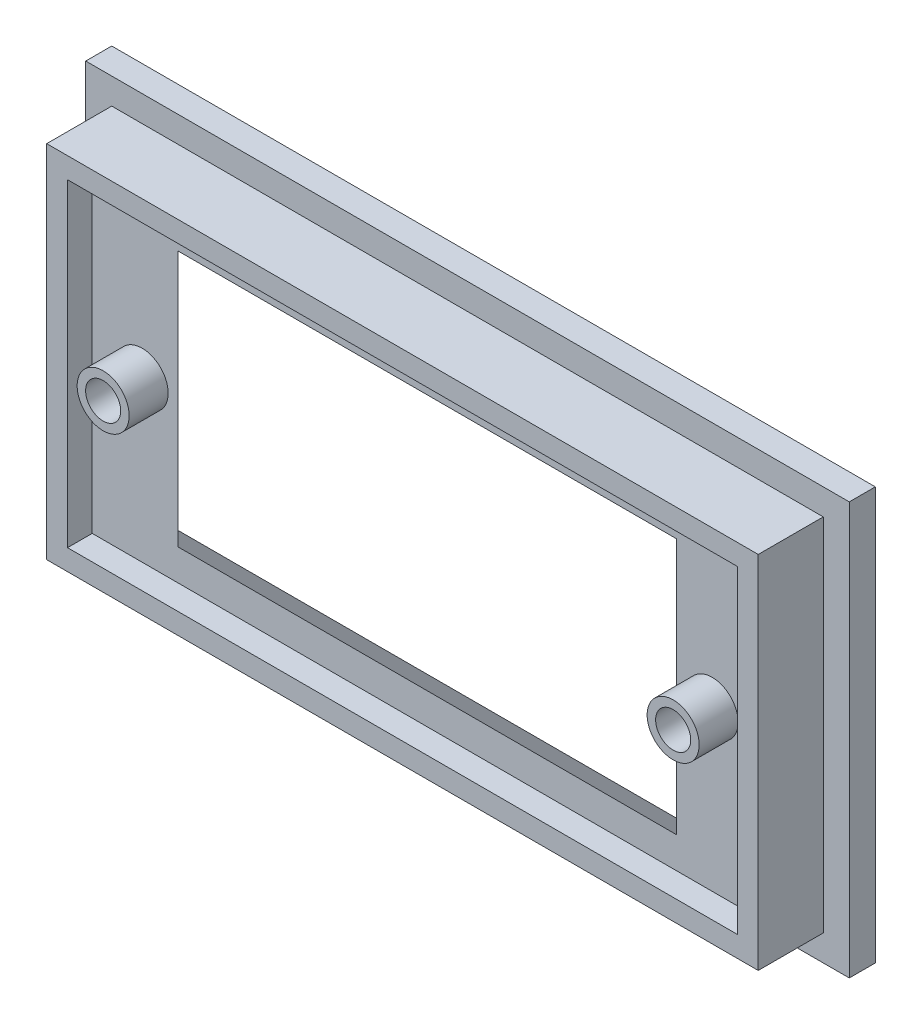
ISO-10303-21;
HEADER;
FILE_DESCRIPTION(('STEP AP214'),'2;1');
FILE_NAME('part.step','',(''),(''),'','','');
FILE_SCHEMA(('AUTOMOTIVE_DESIGN { 1 0 10303 214 1 1 1 1 }'));
ENDSEC;
DATA;
#1=APPLICATION_CONTEXT('core data for automotive mechanical design processes');
#2=APPLICATION_PROTOCOL_DEFINITION('international standard','automotive_design',2000,#1);
#3=PRODUCT_CONTEXT('',#1,'mechanical');
#4=PRODUCT('Part','Part','',(#3));
#5=PRODUCT_RELATED_PRODUCT_CATEGORY('part','',(#4));
#6=PRODUCT_DEFINITION_FORMATION('','',#4);
#7=PRODUCT_DEFINITION_CONTEXT('part definition',#1,'design');
#8=PRODUCT_DEFINITION('design','',#6,#7);
#9=PRODUCT_DEFINITION_SHAPE('','',#8);
#10=(LENGTH_UNIT() NAMED_UNIT(*) SI_UNIT(.MILLI.,.METRE.));
#11=(NAMED_UNIT(*) PLANE_ANGLE_UNIT() SI_UNIT($,.RADIAN.));
#12=(NAMED_UNIT(*) SI_UNIT($,.STERADIAN.) SOLID_ANGLE_UNIT());
#13=UNCERTAINTY_MEASURE_WITH_UNIT(LENGTH_MEASURE(1.E-05),#10,'distance_accuracy_value','');
#14=(GEOMETRIC_REPRESENTATION_CONTEXT(3) GLOBAL_UNCERTAINTY_ASSIGNED_CONTEXT((#13)) GLOBAL_UNIT_ASSIGNED_CONTEXT((#10,
#11,#12)) REPRESENTATION_CONTEXT('',''));
#15=CARTESIAN_POINT('',(0.,0.,0.));
#16=DIRECTION('',(0.,0.,1.));
#17=DIRECTION('',(1.,0.,0.));
#18=AXIS2_PLACEMENT_3D('',#15,#16,#17);
#19=CARTESIAN_POINT('',(0.,0.,0.));
#20=DIRECTION('',(0.,0.,1.));
#21=DIRECTION('',(1.,0.,0.));
#22=AXIS2_PLACEMENT_3D('',#19,#20,#21);
#23=PLANE('',#22);
#24=DIRECTION('',(0.,-1.,0.));
#25=VECTOR('',#24,1.);
#26=CARTESIAN_POINT('',(-40.8503021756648,13.1480392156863,0.));
#27=LINE('',#26,#25);
#28=CARTESIAN_POINT('',(-40.8503021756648,13.1480392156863,0.));
#29=VERTEX_POINT('',#28);
#30=CARTESIAN_POINT('',(-40.8503021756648,-18.5519607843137,0.));
#31=VERTEX_POINT('',#30);
#32=EDGE_CURVE('E274',#29,#31,#27,.T.);
#33=ORIENTED_EDGE('',*,*,#32,.F.);
#34=DIRECTION('',(-1.,0.,0.));
#35=VECTOR('',#34,1.);
#36=CARTESIAN_POINT('',(-40.8503021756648,13.1480392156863,0.));
#37=LINE('',#36,#35);
#38=CARTESIAN_POINT('',(17.8496978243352,13.1480392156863,0.));
#39=VERTEX_POINT('',#38);
#40=EDGE_CURVE('E283',#39,#29,#37,.T.);
#41=ORIENTED_EDGE('',*,*,#40,.F.);
#42=DIRECTION('',(0.,1.,0.));
#43=VECTOR('',#42,1.);
#44=CARTESIAN_POINT('',(17.8496978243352,13.1480392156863,0.));
#45=LINE('',#44,#43);
#46=CARTESIAN_POINT('',(17.8496978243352,-18.5519607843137,0.));
#47=VERTEX_POINT('',#46);
#48=EDGE_CURVE('E280',#47,#39,#45,.T.);
#49=ORIENTED_EDGE('',*,*,#48,.F.);
#50=DIRECTION('',(1.,0.,0.));
#51=VECTOR('',#50,1.);
#52=CARTESIAN_POINT('',(-40.8503021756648,-18.5519607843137,0.));
#53=LINE('',#52,#51);
#54=EDGE_CURVE('E277',#31,#47,#53,.T.);
#55=ORIENTED_EDGE('',*,*,#54,.F.);
#56=EDGE_LOOP('',(#33,#41,#49,#55));
#57=FACE_BOUND('',#56,.T.);
#58=DIRECTION('',(1.,0.,0.));
#59=VECTOR('',#58,1.);
#60=CARTESIAN_POINT('',(-75.4981782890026,11.1480392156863,0.));
#61=LINE('',#60,#59);
#62=CARTESIAN_POINT('',(-38.8503021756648,11.1480392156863,0.));
#63=VERTEX_POINT('',#62);
#64=CARTESIAN_POINT('',(15.8496978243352,11.1480392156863,0.));
#65=VERTEX_POINT('',#64);
#66=EDGE_CURVE('E154',#63,#65,#61,.T.);
#67=ORIENTED_EDGE('',*,*,#66,.F.);
#68=DIRECTION('',(0.,-1.,0.));
#69=VECTOR('',#68,1.);
#70=CARTESIAN_POINT('',(-38.8503021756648,62.0852761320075,0.));
#71=LINE('',#70,#69);
#72=CARTESIAN_POINT('',(-38.8503021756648,-16.5519607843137,0.));
#73=VERTEX_POINT('',#72);
#74=EDGE_CURVE('E161',#63,#73,#71,.T.);
#75=ORIENTED_EDGE('',*,*,#74,.T.);
#76=DIRECTION('',(1.,0.,0.));
#77=VECTOR('',#76,1.);
#78=CARTESIAN_POINT('',(-75.4981782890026,-16.5519607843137,0.));
#79=LINE('',#78,#77);
#80=CARTESIAN_POINT('',(15.8496978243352,-16.5519607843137,0.));
#81=VERTEX_POINT('',#80);
#82=EDGE_CURVE('E156',#73,#81,#79,.T.);
#83=ORIENTED_EDGE('',*,*,#82,.T.);
#84=DIRECTION('',(0.,-1.,0.));
#85=VECTOR('',#84,1.);
#86=CARTESIAN_POINT('',(15.8496978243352,62.0852761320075,0.));
#87=LINE('',#86,#85);
#88=EDGE_CURVE('E152',#65,#81,#87,.T.);
#89=ORIENTED_EDGE('',*,*,#88,.F.);
#90=EDGE_LOOP('',(#67,#75,#83,#89));
#91=FACE_BOUND('',#90,.T.);
#92=ADVANCED_FACE('F38',(#57,#91),#23,.F.);
#93=CARTESIAN_POINT('',(0.,0.,5.1));
#94=DIRECTION('',(0.,0.,1.));
#95=DIRECTION('',(1.,0.,0.));
#96=AXIS2_PLACEMENT_3D('',#93,#94,#95);
#97=PLANE('',#96);
#98=DIRECTION('',(-1.,0.,0.));
#99=VECTOR('',#98,1.);
#100=CARTESIAN_POINT('',(-30.6503021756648,7.14803921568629,5.1));
#101=LINE('',#100,#99);
#102=CARTESIAN_POINT('',(7.64969782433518,7.14803921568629,5.1));
#103=VERTEX_POINT('',#102);
#104=CARTESIAN_POINT('',(-30.6503021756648,7.14803921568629,5.1));
#105=VERTEX_POINT('',#104);
#106=EDGE_CURVE('E296',#103,#105,#101,.T.);
#107=ORIENTED_EDGE('',*,*,#106,.F.);
#108=DIRECTION('',(0.,1.,0.));
#109=VECTOR('',#108,1.);
#110=CARTESIAN_POINT('',(7.64969782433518,7.14803921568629,5.1));
#111=LINE('',#110,#109);
#112=CARTESIAN_POINT('',(7.64969782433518,-12.5519607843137,5.1));
#113=VERTEX_POINT('',#112);
#114=EDGE_CURVE('E173',#113,#103,#111,.T.);
#115=ORIENTED_EDGE('',*,*,#114,.F.);
#116=DIRECTION('',(1.,0.,0.));
#117=VECTOR('',#116,1.);
#118=CARTESIAN_POINT('',(-30.6503021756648,-12.5519607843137,5.1));
#119=LINE('',#118,#117);
#120=CARTESIAN_POINT('',(-30.6503021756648,-12.5519607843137,5.1));
#121=VERTEX_POINT('',#120);
#122=EDGE_CURVE('E232',#121,#113,#119,.T.);
#123=ORIENTED_EDGE('',*,*,#122,.F.);
#124=DIRECTION('',(0.,-1.,0.));
#125=VECTOR('',#124,1.);
#126=CARTESIAN_POINT('',(-30.6503021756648,7.14803921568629,5.1));
#127=LINE('',#126,#125);
#128=EDGE_CURVE('E235',#105,#121,#127,.T.);
#129=ORIENTED_EDGE('',*,*,#128,.F.);
#130=EDGE_LOOP('',(#107,#115,#123,#129));
#131=FACE_BOUND('',#130,.T.);
#132=DIRECTION('',(0.,-1.,0.));
#133=VECTOR('',#132,1.);
#134=CARTESIAN_POINT('',(-37.2503021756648,9.54803921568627,5.1));
#135=LINE('',#134,#133);
#136=CARTESIAN_POINT('',(-37.2503021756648,9.54803921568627,5.1));
#137=VERTEX_POINT('',#136);
#138=CARTESIAN_POINT('',(-37.2503021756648,-14.9519607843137,5.1));
#139=VERTEX_POINT('',#138);
#140=EDGE_CURVE('E201',#137,#139,#135,.T.);
#141=ORIENTED_EDGE('',*,*,#140,.T.);
#142=DIRECTION('',(1.,0.,0.));
#143=VECTOR('',#142,1.);
#144=CARTESIAN_POINT('',(-37.2503021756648,-14.9519607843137,5.1));
#145=LINE('',#144,#143);
#146=CARTESIAN_POINT('',(14.2496978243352,-14.9519607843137,5.1));
#147=VERTEX_POINT('',#146);
#148=EDGE_CURVE('E204',#139,#147,#145,.T.);
#149=ORIENTED_EDGE('',*,*,#148,.T.);
#150=DIRECTION('',(0.,1.,0.));
#151=VECTOR('',#150,1.);
#152=CARTESIAN_POINT('',(14.2496978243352,9.54803921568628,5.1));
#153=LINE('',#152,#151);
#154=CARTESIAN_POINT('',(14.2496978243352,9.54803921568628,5.1));
#155=VERTEX_POINT('',#154);
#156=EDGE_CURVE('E208',#147,#155,#153,.T.);
#157=ORIENTED_EDGE('',*,*,#156,.T.);
#158=DIRECTION('',(-1.,0.,0.));
#159=VECTOR('',#158,1.);
#160=CARTESIAN_POINT('',(-37.2503021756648,9.54803921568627,5.1));
#161=LINE('',#160,#159);
#162=EDGE_CURVE('E211',#155,#137,#161,.T.);
#163=ORIENTED_EDGE('',*,*,#162,.T.);
#164=EDGE_LOOP('',(#141,#149,#157,#163));
#165=FACE_BOUND('',#164,.T.);
#166=CARTESIAN_POINT('',(-33.4103021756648,-2.70196078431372,5.1));
#167=DIRECTION('',(0.,0.,1.));
#168=DIRECTION('',(1.,0.,0.));
#169=AXIS2_PLACEMENT_3D('',#166,#167,#168);
#170=CIRCLE('',#169,2.);
#171=CARTESIAN_POINT('',(-31.4103021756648,-2.70196078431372,5.1));
#172=VERTEX_POINT('',#171);
#173=EDGE_CURVE('E195',#172,#172,#170,.T.);
#174=ORIENTED_EDGE('',*,*,#173,.F.);
#175=EDGE_LOOP('',(#174));
#176=FACE_BOUND('',#175,.T.);
#177=CARTESIAN_POINT('',(10.4096978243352,-2.70196078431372,5.1));
#178=DIRECTION('',(0.,0.,1.));
#179=DIRECTION('',(1.,0.,0.));
#180=AXIS2_PLACEMENT_3D('',#177,#178,#179);
#181=CIRCLE('',#180,2.);
#182=CARTESIAN_POINT('',(12.4096978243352,-2.70196078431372,5.1));
#183=VERTEX_POINT('',#182);
#184=EDGE_CURVE('E186',#183,#183,#181,.T.);
#185=ORIENTED_EDGE('',*,*,#184,.F.);
#186=EDGE_LOOP('',(#185));
#187=FACE_BOUND('',#186,.T.);
#188=ADVANCED_FACE('F306',(#131,#165,#176,#187),#97,.T.);
#189=CARTESIAN_POINT('',(0.,0.,7.));
#190=DIRECTION('',(0.,0.,1.));
#191=DIRECTION('',(1.,0.,0.));
#192=AXIS2_PLACEMENT_3D('',#189,#190,#191);
#193=PLANE('',#192);
#194=DIRECTION('',(0.,-1.,0.));
#195=VECTOR('',#194,1.);
#196=CARTESIAN_POINT('',(-37.2503021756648,9.54803921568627,7.));
#197=LINE('',#196,#195);
#198=CARTESIAN_POINT('',(-37.2503021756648,9.54803921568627,7.));
#199=VERTEX_POINT('',#198);
#200=CARTESIAN_POINT('',(-37.2503021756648,-14.9519607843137,7.));
#201=VERTEX_POINT('',#200);
#202=EDGE_CURVE('E53',#199,#201,#197,.T.);
#203=ORIENTED_EDGE('',*,*,#202,.F.);
#204=DIRECTION('',(-1.,0.,0.));
#205=VECTOR('',#204,1.);
#206=CARTESIAN_POINT('',(-37.2503021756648,9.54803921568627,7.));
#207=LINE('',#206,#205);
#208=CARTESIAN_POINT('',(14.2496978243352,9.54803921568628,7.));
#209=VERTEX_POINT('',#208);
#210=EDGE_CURVE('E205',#209,#199,#207,.T.);
#211=ORIENTED_EDGE('',*,*,#210,.F.);
#212=DIRECTION('',(0.,1.,0.));
#213=VECTOR('',#212,1.);
#214=CARTESIAN_POINT('',(14.2496978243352,9.54803921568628,7.));
#215=LINE('',#214,#213);
#216=CARTESIAN_POINT('',(14.2496978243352,-14.9519607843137,7.));
#217=VERTEX_POINT('',#216);
#218=EDGE_CURVE('E219',#217,#209,#215,.T.);
#219=ORIENTED_EDGE('',*,*,#218,.F.);
#220=DIRECTION('',(1.,0.,0.));
#221=VECTOR('',#220,1.);
#222=CARTESIAN_POINT('',(-37.2503021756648,-14.9519607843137,7.));
#223=LINE('',#222,#221);
#224=EDGE_CURVE('E216',#201,#217,#223,.T.);
#225=ORIENTED_EDGE('',*,*,#224,.F.);
#226=EDGE_LOOP('',(#203,#211,#219,#225));
#227=FACE_BOUND('',#226,.T.);
#228=DIRECTION('',(-1.,0.,0.));
#229=VECTOR('',#228,1.);
#230=CARTESIAN_POINT('',(-38.8503021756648,11.1480392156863,7.));
#231=LINE('',#230,#229);
#232=CARTESIAN_POINT('',(15.8496978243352,11.1480392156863,7.));
#233=VERTEX_POINT('',#232);
#234=CARTESIAN_POINT('',(-38.8503021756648,11.1480392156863,7.));
#235=VERTEX_POINT('',#234);
#236=EDGE_CURVE('E243',#233,#235,#231,.T.);
#237=ORIENTED_EDGE('',*,*,#236,.T.);
#238=DIRECTION('',(0.,-1.,0.));
#239=VECTOR('',#238,1.);
#240=CARTESIAN_POINT('',(-38.8503021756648,11.1480392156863,7.));
#241=LINE('',#240,#239);
#242=CARTESIAN_POINT('',(-38.8503021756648,-16.5519607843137,7.));
#243=VERTEX_POINT('',#242);
#244=EDGE_CURVE('E238',#235,#243,#241,.T.);
#245=ORIENTED_EDGE('',*,*,#244,.T.);
#246=DIRECTION('',(1.,0.,0.));
#247=VECTOR('',#246,1.);
#248=CARTESIAN_POINT('',(-38.8503021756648,-16.5519607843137,7.));
#249=LINE('',#248,#247);
#250=CARTESIAN_POINT('',(15.8496978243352,-16.5519607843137,7.));
#251=VERTEX_POINT('',#250);
#252=EDGE_CURVE('E255',#243,#251,#249,.T.);
#253=ORIENTED_EDGE('',*,*,#252,.T.);
#254=DIRECTION('',(0.,1.,0.));
#255=VECTOR('',#254,1.);
#256=CARTESIAN_POINT('',(15.8496978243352,11.1480392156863,7.));
#257=LINE('',#256,#255);
#258=EDGE_CURVE('E61',#251,#233,#257,.T.);
#259=ORIENTED_EDGE('',*,*,#258,.T.);
#260=EDGE_LOOP('',(#237,#245,#253,#259));
#261=FACE_BOUND('',#260,.T.);
#262=ADVANCED_FACE('F321',(#227,#261),#193,.T.);
#263=CARTESIAN_POINT('',(-40.8503021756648,13.1480392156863,7.));
#264=DIRECTION('',(1.,0.,0.));
#265=DIRECTION('',(0.,0.,-1.));
#266=AXIS2_PLACEMENT_3D('',#263,#264,#265);
#267=PLANE('',#266);
#268=DIRECTION('',(0.,-1.,0.));
#269=VECTOR('',#268,1.);
#270=CARTESIAN_POINT('',(-40.8503021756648,13.1480392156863,2.));
#271=LINE('',#270,#269);
#272=CARTESIAN_POINT('',(-40.8503021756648,13.1480392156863,2.));
#273=VERTEX_POINT('',#272);
#274=CARTESIAN_POINT('',(-40.8503021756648,-18.5519607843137,2.));
#275=VERTEX_POINT('',#274);
#276=EDGE_CURVE('E272',#273,#275,#271,.T.);
#277=ORIENTED_EDGE('',*,*,#276,.F.);
#278=DIRECTION('',(0.,0.,-1.));
#279=VECTOR('',#278,1.);
#280=CARTESIAN_POINT('',(-40.8503021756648,13.1480392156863,7.));
#281=LINE('',#280,#279);
#282=EDGE_CURVE('E286',#273,#29,#281,.T.);
#283=ORIENTED_EDGE('',*,*,#282,.T.);
#284=ORIENTED_EDGE('',*,*,#32,.T.);
#285=DIRECTION('',(0.,0.,-1.));
#286=VECTOR('',#285,1.);
#287=CARTESIAN_POINT('',(-40.8503021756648,-18.5519607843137,7.));
#288=LINE('',#287,#286);
#289=EDGE_CURVE('E292',#275,#31,#288,.T.);
#290=ORIENTED_EDGE('',*,*,#289,.F.);
#291=EDGE_LOOP('',(#277,#283,#284,#290));
#292=FACE_BOUND('',#291,.T.);
#293=ADVANCED_FACE('F40',(#292),#267,.F.);
#294=CARTESIAN_POINT('',(-40.8503021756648,-18.5519607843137,7.));
#295=DIRECTION('',(0.,1.,0.));
#296=DIRECTION('',(0.,0.,1.));
#297=AXIS2_PLACEMENT_3D('',#294,#295,#296);
#298=PLANE('',#297);
#299=DIRECTION('',(1.,0.,0.));
#300=VECTOR('',#299,1.);
#301=CARTESIAN_POINT('',(-40.8503021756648,-18.5519607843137,2.));
#302=LINE('',#301,#300);
#303=CARTESIAN_POINT('',(17.8496978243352,-18.5519607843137,2.));
#304=VERTEX_POINT('',#303);
#305=EDGE_CURVE('E270',#275,#304,#302,.T.);
#306=ORIENTED_EDGE('',*,*,#305,.F.);
#307=ORIENTED_EDGE('',*,*,#289,.T.);
#308=ORIENTED_EDGE('',*,*,#54,.T.);
#309=DIRECTION('',(0.,0.,-1.));
#310=VECTOR('',#309,1.);
#311=CARTESIAN_POINT('',(17.8496978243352,-18.5519607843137,7.));
#312=LINE('',#311,#310);
#313=EDGE_CURVE('E290',#304,#47,#312,.T.);
#314=ORIENTED_EDGE('',*,*,#313,.F.);
#315=EDGE_LOOP('',(#306,#307,#308,#314));
#316=FACE_BOUND('',#315,.T.);
#317=ADVANCED_FACE('F343',(#316),#298,.F.);
#318=CARTESIAN_POINT('',(17.8496978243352,13.1480392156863,7.));
#319=DIRECTION('',(-1.,0.,0.));
#320=DIRECTION('',(0.,-1.,0.));
#321=AXIS2_PLACEMENT_3D('',#318,#319,#320);
#322=PLANE('',#321);
#323=DIRECTION('',(0.,1.,0.));
#324=VECTOR('',#323,1.);
#325=CARTESIAN_POINT('',(17.8496978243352,13.1480392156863,2.));
#326=LINE('',#325,#324);
#327=CARTESIAN_POINT('',(17.8496978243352,13.1480392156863,2.));
#328=VERTEX_POINT('',#327);
#329=EDGE_CURVE('E263',#304,#328,#326,.T.);
#330=ORIENTED_EDGE('',*,*,#329,.F.);
#331=ORIENTED_EDGE('',*,*,#313,.T.);
#332=ORIENTED_EDGE('',*,*,#48,.T.);
#333=DIRECTION('',(0.,0.,-1.));
#334=VECTOR('',#333,1.);
#335=CARTESIAN_POINT('',(17.8496978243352,13.1480392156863,7.));
#336=LINE('',#335,#334);
#337=EDGE_CURVE('E288',#328,#39,#336,.T.);
#338=ORIENTED_EDGE('',*,*,#337,.F.);
#339=EDGE_LOOP('',(#330,#331,#332,#338));
#340=FACE_BOUND('',#339,.T.);
#341=ADVANCED_FACE('F340',(#340),#322,.F.);
#342=CARTESIAN_POINT('',(-40.8503021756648,13.1480392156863,7.));
#343=DIRECTION('',(0.,-1.,0.));
#344=DIRECTION('',(0.,0.,-1.));
#345=AXIS2_PLACEMENT_3D('',#342,#343,#344);
#346=PLANE('',#345);
#347=DIRECTION('',(-1.,0.,0.));
#348=VECTOR('',#347,1.);
#349=CARTESIAN_POINT('',(-40.8503021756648,13.1480392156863,2.));
#350=LINE('',#349,#348);
#351=EDGE_CURVE('E294',#328,#273,#350,.T.);
#352=ORIENTED_EDGE('',*,*,#351,.F.);
#353=ORIENTED_EDGE('',*,*,#337,.T.);
#354=ORIENTED_EDGE('',*,*,#40,.T.);
#355=ORIENTED_EDGE('',*,*,#282,.F.);
#356=EDGE_LOOP('',(#352,#353,#354,#355));
#357=FACE_BOUND('',#356,.T.);
#358=ADVANCED_FACE('F336',(#357),#346,.F.);
#359=CARTESIAN_POINT('',(-11.5003021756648,-2.70196078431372,2.));
#360=DIRECTION('',(0.,0.,1.));
#361=DIRECTION('',(1.,0.,0.));
#362=AXIS2_PLACEMENT_3D('',#359,#360,#361);
#363=PLANE('',#362);
#364=DIRECTION('',(-1.,0.,0.));
#365=VECTOR('',#364,1.);
#366=CARTESIAN_POINT('',(-38.8503021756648,11.1480392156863,2.));
#367=LINE('',#366,#365);
#368=CARTESIAN_POINT('',(15.8496978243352,11.1480392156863,2.));
#369=VERTEX_POINT('',#368);
#370=CARTESIAN_POINT('',(-38.8503021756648,11.1480392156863,2.));
#371=VERTEX_POINT('',#370);
#372=EDGE_CURVE('E249',#369,#371,#367,.T.);
#373=ORIENTED_EDGE('',*,*,#372,.F.);
#374=DIRECTION('',(0.,1.,0.));
#375=VECTOR('',#374,1.);
#376=CARTESIAN_POINT('',(15.8496978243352,11.1480392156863,2.));
#377=LINE('',#376,#375);
#378=CARTESIAN_POINT('',(15.8496978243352,-16.5519607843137,2.));
#379=VERTEX_POINT('',#378);
#380=EDGE_CURVE('E246',#379,#369,#377,.T.);
#381=ORIENTED_EDGE('',*,*,#380,.F.);
#382=DIRECTION('',(1.,0.,0.));
#383=VECTOR('',#382,1.);
#384=CARTESIAN_POINT('',(-38.8503021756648,-16.5519607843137,2.));
#385=LINE('',#384,#383);
#386=CARTESIAN_POINT('',(-38.8503021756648,-16.5519607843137,2.));
#387=VERTEX_POINT('',#386);
#388=EDGE_CURVE('E242',#387,#379,#385,.T.);
#389=ORIENTED_EDGE('',*,*,#388,.F.);
#390=DIRECTION('',(0.,-1.,0.));
#391=VECTOR('',#390,1.);
#392=CARTESIAN_POINT('',(-38.8503021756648,11.1480392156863,2.));
#393=LINE('',#392,#391);
#394=EDGE_CURVE('E239',#371,#387,#393,.T.);
#395=ORIENTED_EDGE('',*,*,#394,.F.);
#396=EDGE_LOOP('',(#373,#381,#389,#395));
#397=FACE_BOUND('',#396,.T.);
#398=ORIENTED_EDGE('',*,*,#276,.T.);
#399=ORIENTED_EDGE('',*,*,#305,.T.);
#400=ORIENTED_EDGE('',*,*,#329,.T.);
#401=ORIENTED_EDGE('',*,*,#351,.T.);
#402=EDGE_LOOP('',(#398,#399,#400,#401));
#403=FACE_BOUND('',#402,.T.);
#404=ADVANCED_FACE('F339',(#397,#403),#363,.T.);
#405=CARTESIAN_POINT('',(-38.8503021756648,11.1480392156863,2.));
#406=DIRECTION('',(-1.,0.,0.));
#407=DIRECTION('',(0.,-1.,0.));
#408=AXIS2_PLACEMENT_3D('',#405,#406,#407);
#409=PLANE('',#408);
#410=ORIENTED_EDGE('',*,*,#244,.F.);
#411=DIRECTION('',(0.,0.,1.));
#412=VECTOR('',#411,1.);
#413=CARTESIAN_POINT('',(-38.8503021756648,11.1480392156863,2.));
#414=LINE('',#413,#412);
#415=EDGE_CURVE('E261',#371,#235,#414,.T.);
#416=ORIENTED_EDGE('',*,*,#415,.F.);
#417=ORIENTED_EDGE('',*,*,#394,.T.);
#418=DIRECTION('',(0.,0.,1.));
#419=VECTOR('',#418,1.);
#420=CARTESIAN_POINT('',(-38.8503021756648,-16.5519607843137,2.));
#421=LINE('',#420,#419);
#422=EDGE_CURVE('E252',#387,#243,#421,.T.);
#423=ORIENTED_EDGE('',*,*,#422,.T.);
#424=EDGE_LOOP('',(#410,#416,#417,#423));
#425=FACE_BOUND('',#424,.T.);
#426=ADVANCED_FACE('F364',(#425),#409,.T.);
#427=CARTESIAN_POINT('',(-38.8503021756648,11.1480392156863,2.));
#428=DIRECTION('',(0.,1.,0.));
#429=DIRECTION('',(-1.,0.,0.));
#430=AXIS2_PLACEMENT_3D('',#427,#428,#429);
#431=PLANE('',#430);
#432=ORIENTED_EDGE('',*,*,#236,.F.);
#433=DIRECTION('',(0.,0.,1.));
#434=VECTOR('',#433,1.);
#435=CARTESIAN_POINT('',(15.8496978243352,11.1480392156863,2.));
#436=LINE('',#435,#434);
#437=EDGE_CURVE('E264',#369,#233,#436,.T.);
#438=ORIENTED_EDGE('',*,*,#437,.F.);
#439=ORIENTED_EDGE('',*,*,#372,.T.);
#440=ORIENTED_EDGE('',*,*,#415,.T.);
#441=EDGE_LOOP('',(#432,#438,#439,#440));
#442=FACE_BOUND('',#441,.T.);
#443=ADVANCED_FACE('F369',(#442),#431,.T.);
#444=CARTESIAN_POINT('',(15.8496978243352,11.1480392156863,2.));
#445=DIRECTION('',(1.,0.,0.));
#446=DIRECTION('',(0.,0.,-1.));
#447=AXIS2_PLACEMENT_3D('',#444,#445,#446);
#448=PLANE('',#447);
#449=ORIENTED_EDGE('',*,*,#258,.F.);
#450=DIRECTION('',(0.,0.,1.));
#451=VECTOR('',#450,1.);
#452=CARTESIAN_POINT('',(15.8496978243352,-16.5519607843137,2.));
#453=LINE('',#452,#451);
#454=EDGE_CURVE('E266',#379,#251,#453,.T.);
#455=ORIENTED_EDGE('',*,*,#454,.F.);
#456=ORIENTED_EDGE('',*,*,#380,.T.);
#457=ORIENTED_EDGE('',*,*,#437,.T.);
#458=EDGE_LOOP('',(#449,#455,#456,#457));
#459=FACE_BOUND('',#458,.T.);
#460=ADVANCED_FACE('F378',(#459),#448,.T.);
#461=CARTESIAN_POINT('',(-38.8503021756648,-16.5519607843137,2.));
#462=DIRECTION('',(0.,-1.,0.));
#463=DIRECTION('',(1.,0.,0.));
#464=AXIS2_PLACEMENT_3D('',#461,#462,#463);
#465=PLANE('',#464);
#466=ORIENTED_EDGE('',*,*,#252,.F.);
#467=ORIENTED_EDGE('',*,*,#422,.F.);
#468=ORIENTED_EDGE('',*,*,#388,.T.);
#469=ORIENTED_EDGE('',*,*,#454,.T.);
#470=EDGE_LOOP('',(#466,#467,#468,#469));
#471=FACE_BOUND('',#470,.T.);
#472=ADVANCED_FACE('F374',(#471),#465,.T.);
#473=CARTESIAN_POINT('',(-37.2503021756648,9.54803921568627,5.1));
#474=DIRECTION('',(-1.,0.,0.));
#475=DIRECTION('',(0.,-1.,0.));
#476=AXIS2_PLACEMENT_3D('',#473,#474,#475);
#477=PLANE('',#476);
#478=ORIENTED_EDGE('',*,*,#202,.T.);
#479=DIRECTION('',(0.,0.,1.));
#480=VECTOR('',#479,1.);
#481=CARTESIAN_POINT('',(-37.2503021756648,-14.9519607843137,5.1));
#482=LINE('',#481,#480);
#483=EDGE_CURVE('E214',#139,#201,#482,.T.);
#484=ORIENTED_EDGE('',*,*,#483,.F.);
#485=ORIENTED_EDGE('',*,*,#140,.F.);
#486=DIRECTION('',(0.,0.,1.));
#487=VECTOR('',#486,1.);
#488=CARTESIAN_POINT('',(-37.2503021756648,9.54803921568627,5.1));
#489=LINE('',#488,#487);
#490=EDGE_CURVE('E224',#137,#199,#489,.T.);
#491=ORIENTED_EDGE('',*,*,#490,.T.);
#492=EDGE_LOOP('',(#478,#484,#485,#491));
#493=FACE_BOUND('',#492,.T.);
#494=ADVANCED_FACE('F377',(#493),#477,.F.);
#495=CARTESIAN_POINT('',(-37.2503021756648,9.54803921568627,5.1));
#496=DIRECTION('',(0.,1.,0.));
#497=DIRECTION('',(-1.,0.,0.));
#498=AXIS2_PLACEMENT_3D('',#495,#496,#497);
#499=PLANE('',#498);
#500=ORIENTED_EDGE('',*,*,#210,.T.);
#501=ORIENTED_EDGE('',*,*,#490,.F.);
#502=ORIENTED_EDGE('',*,*,#162,.F.);
#503=DIRECTION('',(0.,0.,1.));
#504=VECTOR('',#503,1.);
#505=CARTESIAN_POINT('',(14.2496978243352,9.54803921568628,5.1));
#506=LINE('',#505,#504);
#507=EDGE_CURVE('E226',#155,#209,#506,.T.);
#508=ORIENTED_EDGE('',*,*,#507,.T.);
#509=EDGE_LOOP('',(#500,#501,#502,#508));
#510=FACE_BOUND('',#509,.T.);
#511=ADVANCED_FACE('F387',(#510),#499,.F.);
#512=CARTESIAN_POINT('',(14.2496978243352,9.54803921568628,5.1));
#513=DIRECTION('',(1.,0.,0.));
#514=DIRECTION('',(0.,0.,-1.));
#515=AXIS2_PLACEMENT_3D('',#512,#513,#514);
#516=PLANE('',#515);
#517=ORIENTED_EDGE('',*,*,#218,.T.);
#518=ORIENTED_EDGE('',*,*,#507,.F.);
#519=ORIENTED_EDGE('',*,*,#156,.F.);
#520=DIRECTION('',(0.,0.,1.));
#521=VECTOR('',#520,1.);
#522=CARTESIAN_POINT('',(14.2496978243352,-14.9519607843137,5.1));
#523=LINE('',#522,#521);
#524=EDGE_CURVE('E228',#147,#217,#523,.T.);
#525=ORIENTED_EDGE('',*,*,#524,.T.);
#526=EDGE_LOOP('',(#517,#518,#519,#525));
#527=FACE_BOUND('',#526,.T.);
#528=ADVANCED_FACE('F392',(#527),#516,.F.);
#529=CARTESIAN_POINT('',(-37.2503021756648,-14.9519607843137,5.1));
#530=DIRECTION('',(0.,-1.,0.));
#531=DIRECTION('',(1.,0.,0.));
#532=AXIS2_PLACEMENT_3D('',#529,#530,#531);
#533=PLANE('',#532);
#534=ORIENTED_EDGE('',*,*,#224,.T.);
#535=ORIENTED_EDGE('',*,*,#524,.F.);
#536=ORIENTED_EDGE('',*,*,#148,.F.);
#537=ORIENTED_EDGE('',*,*,#483,.T.);
#538=EDGE_LOOP('',(#534,#535,#536,#537));
#539=FACE_BOUND('',#538,.T.);
#540=ADVANCED_FACE('F388',(#539),#533,.F.);
#541=CARTESIAN_POINT('',(-33.4103021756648,-2.70196078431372,8.1));
#542=DIRECTION('',(0.,0.,1.));
#543=DIRECTION('',(1.,0.,0.));
#544=AXIS2_PLACEMENT_3D('',#541,#542,#543);
#545=PLANE('',#544);
#546=CARTESIAN_POINT('',(-33.4103021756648,-2.70196078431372,8.1));
#547=DIRECTION('',(0.,0.,1.));
#548=DIRECTION('',(1.,0.,0.));
#549=AXIS2_PLACEMENT_3D('',#546,#547,#548);
#550=CIRCLE('',#549,2.);
#551=CARTESIAN_POINT('',(-31.4103021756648,-2.70196078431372,8.1));
#552=VERTEX_POINT('',#551);
#553=EDGE_CURVE('E196',#552,#552,#550,.T.);
#554=ORIENTED_EDGE('',*,*,#553,.T.);
#555=EDGE_LOOP('',(#554));
#556=FACE_BOUND('',#555,.T.);
#557=CARTESIAN_POINT('',(-33.4103021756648,-2.70196078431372,8.1));
#558=DIRECTION('',(0.,0.,1.));
#559=DIRECTION('',(1.,0.,0.));
#560=AXIS2_PLACEMENT_3D('',#557,#558,#559);
#561=CIRCLE('',#560,1.35);
#562=CARTESIAN_POINT('',(-32.0603021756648,-2.70196078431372,8.1));
#563=VERTEX_POINT('',#562);
#564=EDGE_CURVE('E190',#563,#563,#561,.T.);
#565=ORIENTED_EDGE('',*,*,#564,.F.);
#566=EDGE_LOOP('',(#565));
#567=FACE_BOUND('',#566,.T.);
#568=ADVANCED_FACE('F391',(#556,#567),#545,.T.);
#569=CARTESIAN_POINT('',(-33.4103021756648,-2.70196078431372,8.1));
#570=DIRECTION('',(0.,0.,-1.));
#571=DIRECTION('',(-1.,0.,0.));
#572=AXIS2_PLACEMENT_3D('',#569,#570,#571);
#573=CYLINDRICAL_SURFACE('',#572,2.);
#574=ORIENTED_EDGE('',*,*,#553,.F.);
#575=EDGE_LOOP('',(#574));
#576=FACE_BOUND('',#575,.T.);
#577=ORIENTED_EDGE('',*,*,#173,.T.);
#578=EDGE_LOOP('',(#577));
#579=FACE_BOUND('',#578,.T.);
#580=ADVANCED_FACE('F315',(#576,#579),#573,.T.);
#581=CARTESIAN_POINT('',(-33.4103021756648,-2.70196078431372,8.1));
#582=DIRECTION('',(0.,0.,-1.));
#583=DIRECTION('',(-1.,0.,0.));
#584=AXIS2_PLACEMENT_3D('',#581,#582,#583);
#585=CYLINDRICAL_SURFACE('',#584,1.35);
#586=ORIENTED_EDGE('',*,*,#564,.T.);
#587=EDGE_LOOP('',(#586));
#588=FACE_BOUND('',#587,.T.);
#589=CARTESIAN_POINT('',(-33.4103021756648,-2.70196078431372,5.1));
#590=DIRECTION('',(0.,0.,1.));
#591=DIRECTION('',(1.,0.,0.));
#592=AXIS2_PLACEMENT_3D('',#589,#590,#591);
#593=CIRCLE('',#592,1.35);
#594=CARTESIAN_POINT('',(-32.0603021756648,-2.70196078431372,5.1));
#595=VERTEX_POINT('',#594);
#596=EDGE_CURVE('E46',#595,#595,#593,.F.);
#597=ORIENTED_EDGE('',*,*,#596,.T.);
#598=EDGE_LOOP('',(#597));
#599=FACE_BOUND('',#598,.T.);
#600=ADVANCED_FACE('F300',(#588,#599),#585,.F.);
#601=ORIENTED_EDGE('',*,*,#596,.F.);
#602=EDGE_LOOP('',(#601));
#603=FACE_BOUND('',#602,.T.);
#604=ADVANCED_FACE('F302',(#603),#97,.T.);
#605=CARTESIAN_POINT('',(10.4096978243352,-2.70196078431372,8.1));
#606=DIRECTION('',(0.,0.,1.));
#607=DIRECTION('',(1.,0.,0.));
#608=AXIS2_PLACEMENT_3D('',#605,#606,#607);
#609=PLANE('',#608);
#610=CARTESIAN_POINT('',(10.4096978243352,-2.70196078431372,8.1));
#611=DIRECTION('',(0.,0.,1.));
#612=DIRECTION('',(1.,0.,0.));
#613=AXIS2_PLACEMENT_3D('',#610,#611,#612);
#614=CIRCLE('',#613,2.);
#615=CARTESIAN_POINT('',(12.4096978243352,-2.70196078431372,8.1));
#616=VERTEX_POINT('',#615);
#617=EDGE_CURVE('E187',#616,#616,#614,.T.);
#618=ORIENTED_EDGE('',*,*,#617,.T.);
#619=EDGE_LOOP('',(#618));
#620=FACE_BOUND('',#619,.T.);
#621=CARTESIAN_POINT('',(10.4096978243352,-2.70196078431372,8.1));
#622=DIRECTION('',(0.,0.,1.));
#623=DIRECTION('',(1.,0.,0.));
#624=AXIS2_PLACEMENT_3D('',#621,#622,#623);
#625=CIRCLE('',#624,1.35);
#626=CARTESIAN_POINT('',(11.7596978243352,-2.70196078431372,8.1));
#627=VERTEX_POINT('',#626);
#628=EDGE_CURVE('E160',#627,#627,#625,.T.);
#629=ORIENTED_EDGE('',*,*,#628,.F.);
#630=EDGE_LOOP('',(#629));
#631=FACE_BOUND('',#630,.T.);
#632=ADVANCED_FACE('F304',(#620,#631),#609,.T.);
#633=CARTESIAN_POINT('',(10.4096978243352,-2.70196078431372,8.1));
#634=DIRECTION('',(0.,0.,-1.));
#635=DIRECTION('',(-1.,0.,0.));
#636=AXIS2_PLACEMENT_3D('',#633,#634,#635);
#637=CYLINDRICAL_SURFACE('',#636,2.);
#638=ORIENTED_EDGE('',*,*,#617,.F.);
#639=EDGE_LOOP('',(#638));
#640=FACE_BOUND('',#639,.T.);
#641=ORIENTED_EDGE('',*,*,#184,.T.);
#642=EDGE_LOOP('',(#641));
#643=FACE_BOUND('',#642,.T.);
#644=ADVANCED_FACE('F312',(#640,#643),#637,.T.);
#645=CARTESIAN_POINT('',(10.4096978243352,-2.70196078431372,8.1));
#646=DIRECTION('',(0.,0.,-1.));
#647=DIRECTION('',(-1.,0.,0.));
#648=AXIS2_PLACEMENT_3D('',#645,#646,#647);
#649=CYLINDRICAL_SURFACE('',#648,1.35);
#650=ORIENTED_EDGE('',*,*,#628,.T.);
#651=EDGE_LOOP('',(#650));
#652=FACE_BOUND('',#651,.T.);
#653=CARTESIAN_POINT('',(10.4096978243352,-2.70196078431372,5.1));
#654=DIRECTION('',(0.,0.,1.));
#655=DIRECTION('',(1.,0.,0.));
#656=AXIS2_PLACEMENT_3D('',#653,#654,#655);
#657=CIRCLE('',#656,1.35);
#658=CARTESIAN_POINT('',(11.7596978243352,-2.70196078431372,5.1));
#659=VERTEX_POINT('',#658);
#660=EDGE_CURVE('E12',#659,#659,#657,.F.);
#661=ORIENTED_EDGE('',*,*,#660,.T.);
#662=EDGE_LOOP('',(#661));
#663=FACE_BOUND('',#662,.T.);
#664=ADVANCED_FACE('F325',(#652,#663),#649,.F.);
#665=ORIENTED_EDGE('',*,*,#660,.F.);
#666=EDGE_LOOP('',(#665));
#667=FACE_BOUND('',#666,.T.);
#668=ADVANCED_FACE('F307',(#667),#97,.T.);
#669=CARTESIAN_POINT('',(-30.6503021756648,62.0852761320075,5.1));
#670=DIRECTION('',(0.528135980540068,0.,-0.849159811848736));
#671=DIRECTION('',(-0.849159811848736,0.,-0.528135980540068));
#672=AXIS2_PLACEMENT_3D('',#669,#670,#671);
#673=PLANE('',#672);
#674=ORIENTED_EDGE('',*,*,#128,.T.);
#675=DIRECTION('',(0.784518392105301,0.382691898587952,0.487932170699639));
#676=VECTOR('',#675,1.);
#677=CARTESIAN_POINT('',(-58.2527844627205,-26.0165862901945,-12.067397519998));
#678=LINE('',#677,#676);
#679=EDGE_CURVE('E179',#73,#121,#678,.T.);
#680=ORIENTED_EDGE('',*,*,#679,.F.);
#681=ORIENTED_EDGE('',*,*,#74,.F.);
#682=DIRECTION('',(-0.784518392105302,0.382691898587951,-0.487932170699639));
#683=VECTOR('',#682,1.);
#684=CARTESIAN_POINT('',(-61.4059377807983,22.1507882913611,-14.0285050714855));
#685=LINE('',#684,#683);
#686=EDGE_CURVE('E169',#105,#63,#685,.T.);
#687=ORIENTED_EDGE('',*,*,#686,.F.);
#688=EDGE_LOOP('',(#674,#680,#681,#687));
#689=FACE_BOUND('',#688,.T.);
#690=ADVANCED_FACE('F324',(#689),#673,.T.);
#691=CARTESIAN_POINT('',(15.8496978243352,62.0852761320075,0.));
#692=DIRECTION('',(-0.528135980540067,0.,-0.849159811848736));
#693=DIRECTION('',(-0.849159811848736,0.,0.528135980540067));
#694=AXIS2_PLACEMENT_3D('',#691,#692,#693);
#695=PLANE('',#694);
#696=ORIENTED_EDGE('',*,*,#88,.T.);
#697=DIRECTION('',(-0.784518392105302,0.382691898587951,0.487932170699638));
#698=VECTOR('',#697,1.);
#699=CARTESIAN_POINT('',(35.2521801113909,-26.0165862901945,-12.0673975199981));
#700=LINE('',#699,#698);
#701=EDGE_CURVE('E175',#81,#113,#700,.T.);
#702=ORIENTED_EDGE('',*,*,#701,.T.);
#703=ORIENTED_EDGE('',*,*,#114,.T.);
#704=DIRECTION('',(0.784518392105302,0.382691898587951,-0.487932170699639));
#705=VECTOR('',#704,1.);
#706=CARTESIAN_POINT('',(38.4053334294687,22.1507882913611,-14.0285050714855));
#707=LINE('',#706,#705);
#708=EDGE_CURVE('E166',#103,#65,#707,.T.);
#709=ORIENTED_EDGE('',*,*,#708,.T.);
#710=EDGE_LOOP('',(#696,#702,#703,#709));
#711=FACE_BOUND('',#710,.T.);
#712=ADVANCED_FACE('F171',(#711),#695,.T.);
#713=CARTESIAN_POINT('',(-75.4981782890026,11.1480392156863,0.));
#714=DIRECTION('',(0.,0.786853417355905,0.617139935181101));
#715=DIRECTION('',(0.,-0.617139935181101,0.786853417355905));
#716=AXIS2_PLACEMENT_3D('',#713,#714,#715);
#717=PLANE('',#716);
#718=ORIENTED_EDGE('',*,*,#686,.T.);
#719=ORIENTED_EDGE('',*,*,#66,.T.);
#720=ORIENTED_EDGE('',*,*,#708,.F.);
#721=ORIENTED_EDGE('',*,*,#106,.T.);
#722=EDGE_LOOP('',(#718,#719,#720,#721));
#723=FACE_BOUND('',#722,.T.);
#724=ADVANCED_FACE('F165',(#723),#717,.F.);
#725=CARTESIAN_POINT('',(-75.4981782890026,-12.5519607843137,5.1));
#726=DIRECTION('',(0.,-0.786853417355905,0.617139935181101));
#727=DIRECTION('',(0.,-0.617139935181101,-0.786853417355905));
#728=AXIS2_PLACEMENT_3D('',#725,#726,#727);
#729=PLANE('',#728);
#730=ORIENTED_EDGE('',*,*,#679,.T.);
#731=ORIENTED_EDGE('',*,*,#122,.T.);
#732=ORIENTED_EDGE('',*,*,#701,.F.);
#733=ORIENTED_EDGE('',*,*,#82,.F.);
#734=EDGE_LOOP('',(#730,#731,#732,#733));
#735=FACE_BOUND('',#734,.T.);
#736=ADVANCED_FACE('F508',(#735),#729,.F.);
#737=CLOSED_SHELL('',(#92,#188,#262,#293,#317,#341,#358,#404,#426,#443,#460,#472,#494,#511,#528,
#540,#568,#580,#600,#604,#632,#644,#664,#668,#690,#712,#724,#736));
#738=MANIFOLD_SOLID_BREP('B2',#737);
#739=ADVANCED_BREP_SHAPE_REPRESENTATION('',(#18,#738),#14);
#740=SHAPE_DEFINITION_REPRESENTATION(#9,#739);
ENDSEC;
END-ISO-10303-21;
